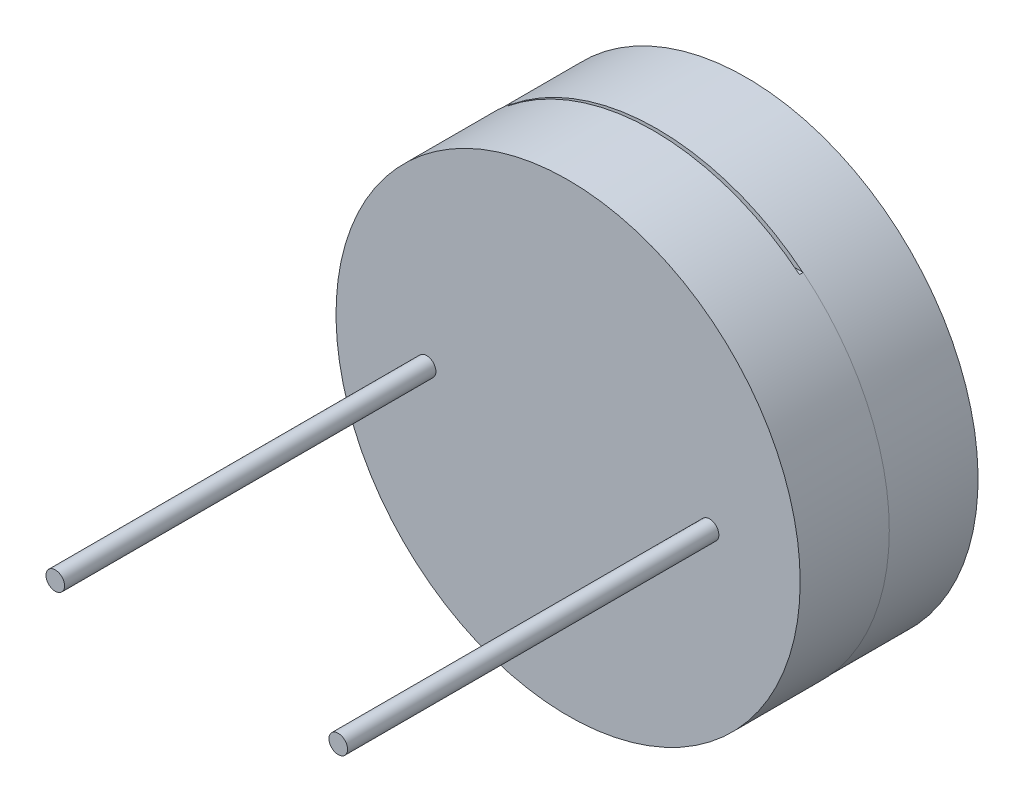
from build123d import *

# Parameters (mm, degrees)
ESQUISSE1_R             = 6.25
EXTRUSION1_DEPTH        = 2.4
ENL_V_MAT_EXTRU_1_DEPTH = 0.1
ESQUISSE2_R             = 6.24
EXTRUSION4_DEPTH        = 2.4
ESQUISSE4_R             = 0.25
EXTRUSION5_DEPTH        = 10


with BuildPart() as part:
    # Esquisse1 → Extrusion1 (new body)
    with BuildSketch(Plane.XY):
        Circle(ESQUISSE1_R)
    extrude(amount=EXTRUSION1_DEPTH)

    # Esquisse3 → Enl_v. mat.-Extru.1 (cut)
    with BuildSketch(Plane(origin=(0, 0, 0), x_dir=(-1, 0, 0), z_dir=(0, 0, -1))):
        with BuildLine():
            Line((3.566666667, 3.858431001), (3.566666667, 4.858431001))
            Line((3.566666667, 4.858431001), (3.931685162, 4.858431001))
            ThreePointArc((3.931685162, 4.858431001), (0, 6.25), (-3.931685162, 4.858431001))
            Line((-3.931685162, 4.858431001), (3.366666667, 4.858431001))
            Line((3.366666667, 4.858431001), (3.366666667, 4.058431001))
            Line((3.366666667, 4.058431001), (-3.233333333, 4.058431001))
            Line((-3.233333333, 4.058431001), (-3.233333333, 3.14731989))
            Line((-3.233333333, 3.14731989), (3.366666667, 3.14731989))
            Line((3.366666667, 3.14731989), (3.366666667, 2.24731989))
            Line((3.366666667, 2.24731989), (-3.233333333, 2.24731989))
            Line((-3.233333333, 2.24731989), (-3.233333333, 1.34731989))
            Line((-3.233333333, 1.34731989), (3.366666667, 1.34731989))
            Line((3.366666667, 1.34731989), (3.366666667, 0.44731989))
            Line((3.366666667, 0.44731989), (-3.233333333, 0.44731989))
            Line((-3.233333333, 0.44731989), (-3.233333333, -0.44731989))
            Line((-3.233333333, -0.44731989), (3.366666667, -0.44731989))
            Line((3.366666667, -0.44731989), (3.366666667, -1.34731989))
            Line((3.366666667, -1.34731989), (-3.233333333, -1.34731989))
            Line((-3.233333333, -1.34731989), (-3.233333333, -2.24731989))
            Line((-3.233333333, -2.24731989), (3.366666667, -2.24731989))
            Line((3.366666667, -2.24731989), (3.366666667, -3.14731989))
            Line((3.366666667, -3.14731989), (-3.233333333, -3.14731989))
            Line((-3.233333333, -3.14731989), (-3.233333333, -4.058431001))
            Line((-3.233333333, -4.058431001), (3.366666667, -4.058431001))
            Line((3.366666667, -4.058431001), (3.366666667, -4.858431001))
            Line((3.366666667, -4.858431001), (-3.931685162, -4.858431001))
            ThreePointArc((-3.931685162, -4.858431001), (-0.003137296, -6.249999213), (3.926805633, -4.862375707))
            Line((3.926805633, -4.862375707), (3.924122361, -4.858431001))
            Line((3.924122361, -4.858431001), (3.566666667, -4.858431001))
            Line((3.566666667, -4.858431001), (3.566666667, -3.858431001))
            Line((3.566666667, -3.858431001), (-3.033333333, -3.858431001))
            Line((-3.033333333, -3.858431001), (-3.033333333, -3.34731989))
            Line((-3.033333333, -3.34731989), (3.566666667, -3.34731989))
            Line((3.566666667, -3.34731989), (3.566666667, -2.04731989))
            Line((3.566666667, -2.04731989), (-3.033333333, -2.04731989))
            Line((-3.033333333, -2.04731989), (-3.033333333, -1.54731989))
            Line((-3.033333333, -1.54731989), (3.566666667, -1.54731989))
            Line((3.566666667, -1.54731989), (3.566666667, -0.24731989))
            Line((3.566666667, -0.24731989), (-3.033333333, -0.24731989))
            Line((-3.033333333, -0.24731989), (-3.033333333, 0.24731989))
            Line((-3.033333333, 0.24731989), (3.566666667, 0.24731989))
            Line((3.566666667, 0.24731989), (3.566666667, 1.54731989))
            Line((3.566666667, 1.54731989), (-3.033333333, 1.54731989))
            Line((-3.033333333, 1.54731989), (-3.033333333, 2.04731989))
            Line((-3.033333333, 2.04731989), (3.566666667, 2.04731989))
            Line((3.566666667, 2.04731989), (3.566666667, 3.34731989))
            Line((3.566666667, 3.34731989), (-3.033333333, 3.34731989))
            Line((-3.033333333, 3.34731989), (-3.033333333, 3.858431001))
            Line((-3.033333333, 3.858431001), (3.566666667, 3.858431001))
        make_face()
    extrude(amount=-ENL_V_MAT_EXTRU_1_DEPTH, mode=Mode.SUBTRACT)

    # Esquisse2 → Extrusion4 (add)
    with BuildSketch(Plane(origin=(0, 0, 0), x_dir=(-1, 0, 0), z_dir=(0, 0, -1))):
        with Locations(Location((0, 0, 0), (0, 0, 231.132087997))):
            Circle(ESQUISSE2_R)
    extrude(amount=EXTRUSION4_DEPTH)

    # Esquisse4 → Extrusion5 (add)
    with BuildSketch(Plane.XY.offset(2.4)):
        with Locations((3.81, 0)):
            Circle(ESQUISSE4_R)
        with Locations(Location((-3.81, 0, 0), (0, 0, 180))):
            Circle(ESQUISSE4_R)
    extrude(amount=EXTRUSION5_DEPTH)


solid = part.part
